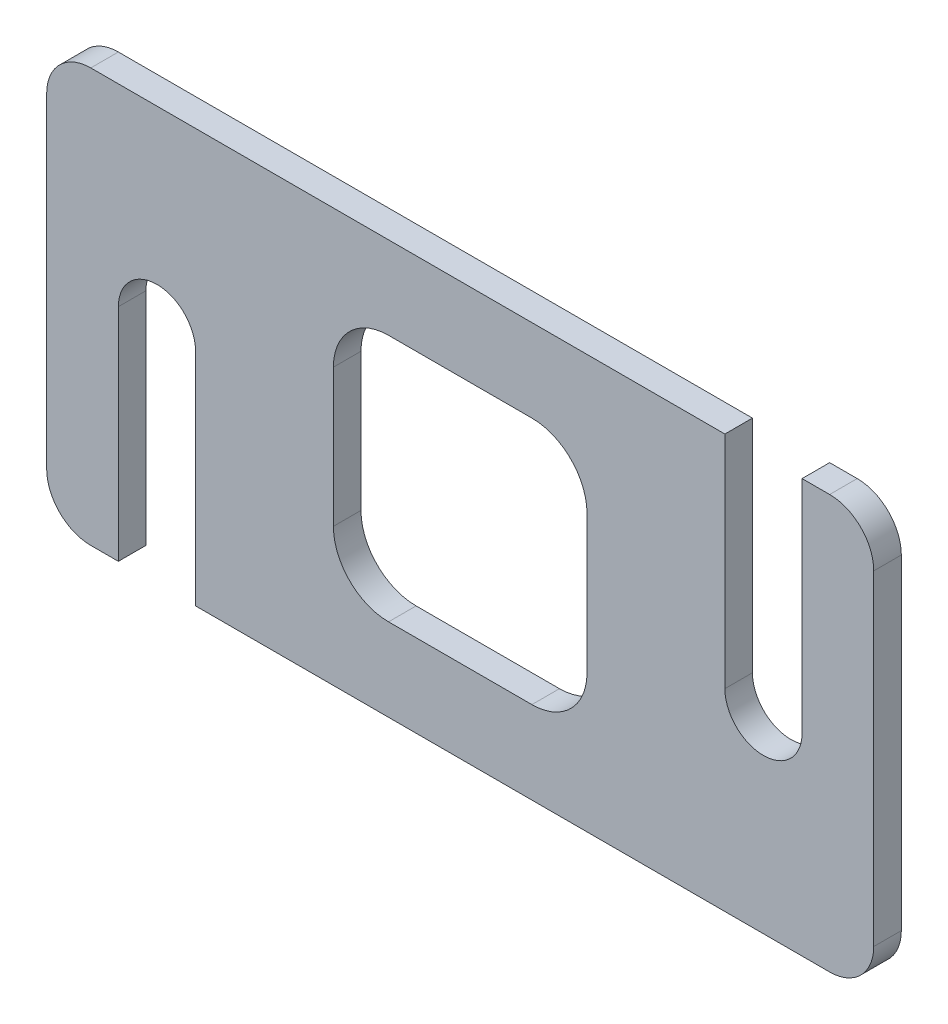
ISO-10303-21;
HEADER;
FILE_DESCRIPTION(('STEP AP214'),'2;1');
FILE_NAME('part.step','',(''),(''),'','','');
FILE_SCHEMA(('AUTOMOTIVE_DESIGN { 1 0 10303 214 1 1 1 1 }'));
ENDSEC;
DATA;
#1=APPLICATION_CONTEXT('core data for automotive mechanical design processes');
#2=APPLICATION_PROTOCOL_DEFINITION('international standard','automotive_design',2000,#1);
#3=PRODUCT_CONTEXT('',#1,'mechanical');
#4=PRODUCT('Part','Part','',(#3));
#5=PRODUCT_RELATED_PRODUCT_CATEGORY('part','',(#4));
#6=PRODUCT_DEFINITION_FORMATION('','',#4);
#7=PRODUCT_DEFINITION_CONTEXT('part definition',#1,'design');
#8=PRODUCT_DEFINITION('design','',#6,#7);
#9=PRODUCT_DEFINITION_SHAPE('','',#8);
#10=(LENGTH_UNIT() NAMED_UNIT(*) SI_UNIT(.MILLI.,.METRE.));
#11=(NAMED_UNIT(*) PLANE_ANGLE_UNIT() SI_UNIT($,.RADIAN.));
#12=(NAMED_UNIT(*) SI_UNIT($,.STERADIAN.) SOLID_ANGLE_UNIT());
#13=UNCERTAINTY_MEASURE_WITH_UNIT(LENGTH_MEASURE(1.E-05),#10,'distance_accuracy_value','');
#14=(GEOMETRIC_REPRESENTATION_CONTEXT(3) GLOBAL_UNCERTAINTY_ASSIGNED_CONTEXT((#13)) GLOBAL_UNIT_ASSIGNED_CONTEXT((#10,
#11,#12)) REPRESENTATION_CONTEXT('',''));
#15=CARTESIAN_POINT('',(0.,0.,0.));
#16=DIRECTION('',(0.,0.,1.));
#17=DIRECTION('',(1.,0.,0.));
#18=AXIS2_PLACEMENT_3D('',#15,#16,#17);
#19=CARTESIAN_POINT('',(-75.,37.5,5.));
#20=DIRECTION('',(0.,-1.,0.));
#21=DIRECTION('',(0.,0.,-1.));
#22=AXIS2_PLACEMENT_3D('',#19,#20,#21);
#23=PLANE('',#22);
#24=DIRECTION('',(-1.,0.,0.));
#25=VECTOR('',#24,1.);
#26=CARTESIAN_POINT('',(-75.,37.5,0.));
#27=LINE('',#26,#25);
#28=CARTESIAN_POINT('',(48.,37.5,0.));
#29=VERTEX_POINT('',#28);
#30=CARTESIAN_POINT('',(-67.,37.5,0.));
#31=VERTEX_POINT('',#30);
#32=EDGE_CURVE('E341',#29,#31,#27,.T.);
#33=ORIENTED_EDGE('',*,*,#32,.T.);
#34=DIRECTION('',(0.,0.,-1.));
#35=VECTOR('',#34,1.);
#36=CARTESIAN_POINT('',(-67.,37.5,5.));
#37=LINE('',#36,#35);
#38=CARTESIAN_POINT('',(-67.,37.5,5.));
#39=VERTEX_POINT('',#38);
#40=EDGE_CURVE('E361',#31,#39,#37,.F.);
#41=ORIENTED_EDGE('',*,*,#40,.T.);
#42=DIRECTION('',(-1.,0.,0.));
#43=VECTOR('',#42,1.);
#44=CARTESIAN_POINT('',(-75.,37.5,5.));
#45=LINE('',#44,#43);
#46=CARTESIAN_POINT('',(48.,37.5,5.));
#47=VERTEX_POINT('',#46);
#48=EDGE_CURVE('E329',#47,#39,#45,.T.);
#49=ORIENTED_EDGE('',*,*,#48,.F.);
#50=DIRECTION('',(0.,0.,1.));
#51=VECTOR('',#50,1.);
#52=CARTESIAN_POINT('',(48.,37.5,0.));
#53=LINE('',#52,#51);
#54=EDGE_CURVE('E291',#29,#47,#53,.T.);
#55=ORIENTED_EDGE('',*,*,#54,.F.);
#56=EDGE_LOOP('',(#33,#41,#49,#55));
#57=FACE_BOUND('',#56,.T.);
#58=ADVANCED_FACE('F34',(#57),#23,.F.);
#59=CARTESIAN_POINT('',(-75.,-37.5,5.));
#60=DIRECTION('',(0.,1.,0.));
#61=DIRECTION('',(0.,0.,1.));
#62=AXIS2_PLACEMENT_3D('',#59,#60,#61);
#63=PLANE('',#62);
#64=DIRECTION('',(1.,0.,0.));
#65=VECTOR('',#64,1.);
#66=CARTESIAN_POINT('',(-75.,-37.5,5.));
#67=LINE('',#66,#65);
#68=CARTESIAN_POINT('',(-67.,-37.5,5.));
#69=VERTEX_POINT('',#68);
#70=CARTESIAN_POINT('',(-62.,-37.5,5.));
#71=VERTEX_POINT('',#70);
#72=EDGE_CURVE('E337',#69,#71,#67,.T.);
#73=ORIENTED_EDGE('',*,*,#72,.F.);
#74=DIRECTION('',(0.,0.,-1.));
#75=VECTOR('',#74,1.);
#76=CARTESIAN_POINT('',(-67.,-37.5,5.));
#77=LINE('',#76,#75);
#78=CARTESIAN_POINT('',(-67.,-37.5,0.));
#79=VERTEX_POINT('',#78);
#80=EDGE_CURVE('E11',#69,#79,#77,.T.);
#81=ORIENTED_EDGE('',*,*,#80,.T.);
#82=DIRECTION('',(1.,0.,0.));
#83=VECTOR('',#82,1.);
#84=CARTESIAN_POINT('',(-75.,-37.5,0.));
#85=LINE('',#84,#83);
#86=CARTESIAN_POINT('',(-62.,-37.5,0.));
#87=VERTEX_POINT('',#86);
#88=EDGE_CURVE('E330',#79,#87,#85,.T.);
#89=ORIENTED_EDGE('',*,*,#88,.T.);
#90=DIRECTION('',(0.,0.,1.));
#91=VECTOR('',#90,1.);
#92=CARTESIAN_POINT('',(-62.,-37.5,0.));
#93=LINE('',#92,#91);
#94=EDGE_CURVE('E310',#87,#71,#93,.T.);
#95=ORIENTED_EDGE('',*,*,#94,.T.);
#96=EDGE_LOOP('',(#73,#81,#89,#95));
#97=FACE_BOUND('',#96,.T.);
#98=ADVANCED_FACE('F432',(#97),#63,.F.);
#99=CARTESIAN_POINT('',(75.,-37.5,5.));
#100=DIRECTION('',(-1.,0.,0.));
#101=DIRECTION('',(0.,0.,1.));
#102=AXIS2_PLACEMENT_3D('',#99,#100,#101);
#103=PLANE('',#102);
#104=DIRECTION('',(0.,1.,0.));
#105=VECTOR('',#104,1.);
#106=CARTESIAN_POINT('',(75.,-37.5,0.));
#107=LINE('',#106,#105);
#108=CARTESIAN_POINT('',(75.,-29.5,0.));
#109=VERTEX_POINT('',#108);
#110=CARTESIAN_POINT('',(75.,29.5,0.));
#111=VERTEX_POINT('',#110);
#112=EDGE_CURVE('E320',#109,#111,#107,.T.);
#113=ORIENTED_EDGE('',*,*,#112,.T.);
#114=DIRECTION('',(0.,0.,-1.));
#115=VECTOR('',#114,1.);
#116=CARTESIAN_POINT('',(75.,29.5,5.));
#117=LINE('',#116,#115);
#118=CARTESIAN_POINT('',(75.,29.5,5.));
#119=VERTEX_POINT('',#118);
#120=EDGE_CURVE('E57',#111,#119,#117,.F.);
#121=ORIENTED_EDGE('',*,*,#120,.T.);
#122=DIRECTION('',(0.,1.,0.));
#123=VECTOR('',#122,1.);
#124=CARTESIAN_POINT('',(75.,-37.5,5.));
#125=LINE('',#124,#123);
#126=CARTESIAN_POINT('',(75.,-29.5,5.));
#127=VERTEX_POINT('',#126);
#128=EDGE_CURVE('E327',#127,#119,#125,.T.);
#129=ORIENTED_EDGE('',*,*,#128,.F.);
#130=DIRECTION('',(0.,0.,-1.));
#131=VECTOR('',#130,1.);
#132=CARTESIAN_POINT('',(75.,-29.5,5.));
#133=LINE('',#132,#131);
#134=EDGE_CURVE('E373',#127,#109,#133,.T.);
#135=ORIENTED_EDGE('',*,*,#134,.T.);
#136=EDGE_LOOP('',(#113,#121,#129,#135));
#137=FACE_BOUND('',#136,.T.);
#138=ADVANCED_FACE('F393',(#137),#103,.F.);
#139=CARTESIAN_POINT('',(67.,37.5,5.));
#140=VERTEX_POINT('',#139);
#141=CARTESIAN_POINT('',(62.,37.5,5.));
#142=VERTEX_POINT('',#141);
#143=EDGE_CURVE('E331',#140,#142,#45,.T.);
#144=ORIENTED_EDGE('',*,*,#143,.F.);
#145=DIRECTION('',(0.,0.,-1.));
#146=VECTOR('',#145,1.);
#147=CARTESIAN_POINT('',(67.,37.5,5.));
#148=LINE('',#147,#146);
#149=CARTESIAN_POINT('',(67.,37.5,0.));
#150=VERTEX_POINT('',#149);
#151=EDGE_CURVE('E370',#140,#150,#148,.T.);
#152=ORIENTED_EDGE('',*,*,#151,.T.);
#153=CARTESIAN_POINT('',(62.,37.5,0.));
#154=VERTEX_POINT('',#153);
#155=EDGE_CURVE('E342',#150,#154,#27,.T.);
#156=ORIENTED_EDGE('',*,*,#155,.T.);
#157=DIRECTION('',(0.,0.,1.));
#158=VECTOR('',#157,1.);
#159=CARTESIAN_POINT('',(62.,37.5,0.));
#160=LINE('',#159,#158);
#161=EDGE_CURVE('E294',#154,#142,#160,.T.);
#162=ORIENTED_EDGE('',*,*,#161,.T.);
#163=EDGE_LOOP('',(#144,#152,#156,#162));
#164=FACE_BOUND('',#163,.T.);
#165=ADVANCED_FACE('F400',(#164),#23,.F.);
#166=CARTESIAN_POINT('',(-75.,-37.5,5.));
#167=DIRECTION('',(1.,0.,0.));
#168=DIRECTION('',(0.,0.,-1.));
#169=AXIS2_PLACEMENT_3D('',#166,#167,#168);
#170=PLANE('',#169);
#171=DIRECTION('',(0.,-1.,0.));
#172=VECTOR('',#171,1.);
#173=CARTESIAN_POINT('',(-75.,-37.5,5.));
#174=LINE('',#173,#172);
#175=CARTESIAN_POINT('',(-75.,29.5,5.));
#176=VERTEX_POINT('',#175);
#177=CARTESIAN_POINT('',(-75.,-29.5,5.));
#178=VERTEX_POINT('',#177);
#179=EDGE_CURVE('E333',#176,#178,#174,.T.);
#180=ORIENTED_EDGE('',*,*,#179,.F.);
#181=DIRECTION('',(0.,0.,-1.));
#182=VECTOR('',#181,1.);
#183=CARTESIAN_POINT('',(-75.,29.5,5.));
#184=LINE('',#183,#182);
#185=CARTESIAN_POINT('',(-75.,29.5,0.));
#186=VERTEX_POINT('',#185);
#187=EDGE_CURVE('E350',#176,#186,#184,.T.);
#188=ORIENTED_EDGE('',*,*,#187,.T.);
#189=DIRECTION('',(0.,-1.,0.));
#190=VECTOR('',#189,1.);
#191=CARTESIAN_POINT('',(-75.,-37.5,0.));
#192=LINE('',#191,#190);
#193=CARTESIAN_POINT('',(-75.,-29.5,0.));
#194=VERTEX_POINT('',#193);
#195=EDGE_CURVE('E344',#186,#194,#192,.T.);
#196=ORIENTED_EDGE('',*,*,#195,.T.);
#197=DIRECTION('',(0.,0.,-1.));
#198=VECTOR('',#197,1.);
#199=CARTESIAN_POINT('',(-75.,-29.5,5.));
#200=LINE('',#199,#198);
#201=EDGE_CURVE('E339',#194,#178,#200,.F.);
#202=ORIENTED_EDGE('',*,*,#201,.T.);
#203=EDGE_LOOP('',(#180,#188,#196,#202));
#204=FACE_BOUND('',#203,.T.);
#205=ADVANCED_FACE('F425',(#204),#170,.F.);
#206=CARTESIAN_POINT('',(-48.,-37.5,0.));
#207=VERTEX_POINT('',#206);
#208=CARTESIAN_POINT('',(67.,-37.5,0.));
#209=VERTEX_POINT('',#208);
#210=EDGE_CURVE('E347',#207,#209,#85,.T.);
#211=ORIENTED_EDGE('',*,*,#210,.T.);
#212=DIRECTION('',(0.,0.,-1.));
#213=VECTOR('',#212,1.);
#214=CARTESIAN_POINT('',(67.,-37.5,5.));
#215=LINE('',#214,#213);
#216=CARTESIAN_POINT('',(67.,-37.5,5.));
#217=VERTEX_POINT('',#216);
#218=EDGE_CURVE('E42',#209,#217,#215,.F.);
#219=ORIENTED_EDGE('',*,*,#218,.T.);
#220=CARTESIAN_POINT('',(-48.,-37.5,5.));
#221=VERTEX_POINT('',#220);
#222=EDGE_CURVE('E336',#221,#217,#67,.T.);
#223=ORIENTED_EDGE('',*,*,#222,.F.);
#224=DIRECTION('',(0.,0.,1.));
#225=VECTOR('',#224,1.);
#226=CARTESIAN_POINT('',(-48.,-37.5,0.));
#227=LINE('',#226,#225);
#228=EDGE_CURVE('E323',#207,#221,#227,.T.);
#229=ORIENTED_EDGE('',*,*,#228,.F.);
#230=EDGE_LOOP('',(#211,#219,#223,#229));
#231=FACE_BOUND('',#230,.T.);
#232=ADVANCED_FACE('F381',(#231),#63,.F.);
#233=CARTESIAN_POINT('',(0.,0.,5.));
#234=DIRECTION('',(0.,0.,-1.));
#235=DIRECTION('',(-1.,0.,0.));
#236=AXIS2_PLACEMENT_3D('',#233,#234,#235);
#237=PLANE('',#236);
#238=DIRECTION('',(0.,-1.,0.));
#239=VECTOR('',#238,1.);
#240=CARTESIAN_POINT('',(-23.,12.5,5.));
#241=LINE('',#240,#239);
#242=CARTESIAN_POINT('',(-23.,12.5,5.));
#243=VERTEX_POINT('',#242);
#244=CARTESIAN_POINT('',(-23.,-12.4999999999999,5.));
#245=VERTEX_POINT('',#244);
#246=EDGE_CURVE('E243',#243,#245,#241,.T.);
#247=ORIENTED_EDGE('',*,*,#246,.F.);
#248=CARTESIAN_POINT('',(-13.,12.5,5.));
#249=DIRECTION('',(0.,0.,1.));
#250=DIRECTION('',(1.,0.,0.));
#251=AXIS2_PLACEMENT_3D('',#248,#249,#250);
#252=CIRCLE('',#251,10.);
#253=CARTESIAN_POINT('',(-13.,22.5,5.));
#254=VERTEX_POINT('',#253);
#255=EDGE_CURVE('E204',#254,#243,#252,.T.);
#256=ORIENTED_EDGE('',*,*,#255,.F.);
#257=DIRECTION('',(-1.,0.,0.));
#258=VECTOR('',#257,1.);
#259=CARTESIAN_POINT('',(-13.,22.5,5.));
#260=LINE('',#259,#258);
#261=CARTESIAN_POINT('',(12.9999999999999,22.5,5.));
#262=VERTEX_POINT('',#261);
#263=EDGE_CURVE('E223',#262,#254,#260,.T.);
#264=ORIENTED_EDGE('',*,*,#263,.F.);
#265=CARTESIAN_POINT('',(13.,12.5,5.));
#266=DIRECTION('',(0.,0.,1.));
#267=DIRECTION('',(-1.,0.,0.));
#268=AXIS2_PLACEMENT_3D('',#265,#266,#267);
#269=CIRCLE('',#268,10.);
#270=CARTESIAN_POINT('',(23.,12.4999999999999,5.));
#271=VERTEX_POINT('',#270);
#272=EDGE_CURVE('E226',#271,#262,#269,.T.);
#273=ORIENTED_EDGE('',*,*,#272,.F.);
#274=DIRECTION('',(0.,1.,0.));
#275=VECTOR('',#274,1.);
#276=CARTESIAN_POINT('',(23.,12.4999999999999,5.));
#277=LINE('',#276,#275);
#278=CARTESIAN_POINT('',(23.,-12.4999999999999,5.));
#279=VERTEX_POINT('',#278);
#280=EDGE_CURVE('E254',#279,#271,#277,.T.);
#281=ORIENTED_EDGE('',*,*,#280,.F.);
#282=CARTESIAN_POINT('',(13.,-12.5,5.));
#283=DIRECTION('',(0.,0.,1.));
#284=DIRECTION('',(1.,0.,0.));
#285=AXIS2_PLACEMENT_3D('',#282,#283,#284);
#286=CIRCLE('',#285,10.);
#287=CARTESIAN_POINT('',(12.9999999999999,-22.5,5.));
#288=VERTEX_POINT('',#287);
#289=EDGE_CURVE('E251',#288,#279,#286,.T.);
#290=ORIENTED_EDGE('',*,*,#289,.F.);
#291=DIRECTION('',(1.,0.,0.));
#292=VECTOR('',#291,1.);
#293=CARTESIAN_POINT('',(-12.9999999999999,-22.5,5.));
#294=LINE('',#293,#292);
#295=CARTESIAN_POINT('',(-12.9999999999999,-22.5,5.));
#296=VERTEX_POINT('',#295);
#297=EDGE_CURVE('E248',#296,#288,#294,.T.);
#298=ORIENTED_EDGE('',*,*,#297,.F.);
#299=CARTESIAN_POINT('',(-13.,-12.5,5.));
#300=DIRECTION('',(0.,0.,1.));
#301=DIRECTION('',(1.,0.,0.));
#302=AXIS2_PLACEMENT_3D('',#299,#300,#301);
#303=CIRCLE('',#302,10.);
#304=EDGE_CURVE('E245',#245,#296,#303,.T.);
#305=ORIENTED_EDGE('',*,*,#304,.F.);
#306=EDGE_LOOP('',(#247,#256,#264,#273,#281,#290,#298,#305));
#307=FACE_BOUND('',#306,.T.);
#308=ORIENTED_EDGE('',*,*,#48,.T.);
#309=CARTESIAN_POINT('',(-67.,29.5,5.));
#310=DIRECTION('',(0.,0.,-1.));
#311=DIRECTION('',(-1.,0.,0.));
#312=AXIS2_PLACEMENT_3D('',#309,#310,#311);
#313=CIRCLE('',#312,8.);
#314=EDGE_CURVE('E368',#39,#176,#313,.F.);
#315=ORIENTED_EDGE('',*,*,#314,.T.);
#316=ORIENTED_EDGE('',*,*,#179,.T.);
#317=CARTESIAN_POINT('',(-67.,-29.5,5.));
#318=DIRECTION('',(0.,0.,-1.));
#319=DIRECTION('',(-1.,0.,0.));
#320=AXIS2_PLACEMENT_3D('',#317,#318,#319);
#321=CIRCLE('',#320,8.);
#322=EDGE_CURVE('E363',#178,#69,#321,.F.);
#323=ORIENTED_EDGE('',*,*,#322,.T.);
#324=ORIENTED_EDGE('',*,*,#72,.T.);
#325=DIRECTION('',(0.,-1.,0.));
#326=VECTOR('',#325,1.);
#327=CARTESIAN_POINT('',(-62.,-37.5,5.));
#328=LINE('',#327,#326);
#329=CARTESIAN_POINT('',(-62.,2.49999999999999,5.));
#330=VERTEX_POINT('',#329);
#331=EDGE_CURVE('E293',#330,#71,#328,.T.);
#332=ORIENTED_EDGE('',*,*,#331,.F.);
#333=CARTESIAN_POINT('',(-55.,2.49999999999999,5.));
#334=DIRECTION('',(0.,0.,1.));
#335=DIRECTION('',(1.,0.,0.));
#336=AXIS2_PLACEMENT_3D('',#333,#334,#335);
#337=CIRCLE('',#336,7.);
#338=CARTESIAN_POINT('',(-48.,2.49999999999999,5.));
#339=VERTEX_POINT('',#338);
#340=EDGE_CURVE('E304',#339,#330,#337,.T.);
#341=ORIENTED_EDGE('',*,*,#340,.F.);
#342=DIRECTION('',(0.,1.,0.));
#343=VECTOR('',#342,1.);
#344=CARTESIAN_POINT('',(-48.,-37.5,5.));
#345=LINE('',#344,#343);
#346=EDGE_CURVE('E313',#221,#339,#345,.T.);
#347=ORIENTED_EDGE('',*,*,#346,.F.);
#348=ORIENTED_EDGE('',*,*,#222,.T.);
#349=CARTESIAN_POINT('',(67.,-29.5,5.));
#350=DIRECTION('',(0.,0.,-1.));
#351=DIRECTION('',(-1.,0.,0.));
#352=AXIS2_PLACEMENT_3D('',#349,#350,#351);
#353=CIRCLE('',#352,8.);
#354=EDGE_CURVE('E365',#217,#127,#353,.F.);
#355=ORIENTED_EDGE('',*,*,#354,.T.);
#356=ORIENTED_EDGE('',*,*,#128,.T.);
#357=CARTESIAN_POINT('',(67.,29.5,5.));
#358=DIRECTION('',(0.,0.,-1.));
#359=DIRECTION('',(-1.,0.,0.));
#360=AXIS2_PLACEMENT_3D('',#357,#358,#359);
#361=CIRCLE('',#360,8.);
#362=EDGE_CURVE('E49',#119,#140,#361,.F.);
#363=ORIENTED_EDGE('',*,*,#362,.T.);
#364=ORIENTED_EDGE('',*,*,#143,.T.);
#365=DIRECTION('',(0.,1.,0.));
#366=VECTOR('',#365,1.);
#367=CARTESIAN_POINT('',(62.,37.5,5.));
#368=LINE('',#367,#366);
#369=CARTESIAN_POINT('',(62.,-2.50000000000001,5.));
#370=VERTEX_POINT('',#369);
#371=EDGE_CURVE('E277',#370,#142,#368,.T.);
#372=ORIENTED_EDGE('',*,*,#371,.F.);
#373=CARTESIAN_POINT('',(55.,-2.50000000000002,5.));
#374=DIRECTION('',(0.,0.,1.));
#375=DIRECTION('',(1.,0.,0.));
#376=AXIS2_PLACEMENT_3D('',#373,#374,#375);
#377=CIRCLE('',#376,7.);
#378=CARTESIAN_POINT('',(48.,-2.50000000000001,5.));
#379=VERTEX_POINT('',#378);
#380=EDGE_CURVE('E286',#379,#370,#377,.T.);
#381=ORIENTED_EDGE('',*,*,#380,.F.);
#382=DIRECTION('',(0.,-1.,0.));
#383=VECTOR('',#382,1.);
#384=CARTESIAN_POINT('',(48.,37.5,5.));
#385=LINE('',#384,#383);
#386=EDGE_CURVE('E261',#47,#379,#385,.T.);
#387=ORIENTED_EDGE('',*,*,#386,.F.);
#388=EDGE_LOOP('',(#308,#315,#316,#323,#324,#332,#341,#347,#348,#355,#356,#363,#364,#372,#381,#387));
#389=FACE_BOUND('',#388,.T.);
#390=ADVANCED_FACE('F388',(#307,#389),#237,.F.);
#391=CARTESIAN_POINT('',(0.,0.,0.));
#392=DIRECTION('',(0.,0.,-1.));
#393=DIRECTION('',(-1.,0.,0.));
#394=AXIS2_PLACEMENT_3D('',#391,#392,#393);
#395=PLANE('',#394);
#396=CARTESIAN_POINT('',(-13.,12.5,0.));
#397=DIRECTION('',(0.,0.,1.));
#398=DIRECTION('',(1.,0.,0.));
#399=AXIS2_PLACEMENT_3D('',#396,#397,#398);
#400=CIRCLE('',#399,10.);
#401=CARTESIAN_POINT('',(-13.,22.5,0.));
#402=VERTEX_POINT('',#401);
#403=CARTESIAN_POINT('',(-23.,12.5,0.));
#404=VERTEX_POINT('',#403);
#405=EDGE_CURVE('E201',#402,#404,#400,.T.);
#406=ORIENTED_EDGE('',*,*,#405,.T.);
#407=DIRECTION('',(0.,-1.,0.));
#408=VECTOR('',#407,1.);
#409=CARTESIAN_POINT('',(-23.,12.5,0.));
#410=LINE('',#409,#408);
#411=CARTESIAN_POINT('',(-23.,-12.4999999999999,0.));
#412=VERTEX_POINT('',#411);
#413=EDGE_CURVE('E213',#404,#412,#410,.T.);
#414=ORIENTED_EDGE('',*,*,#413,.T.);
#415=CARTESIAN_POINT('',(-13.,-12.5,0.));
#416=DIRECTION('',(0.,0.,1.));
#417=DIRECTION('',(1.,0.,0.));
#418=AXIS2_PLACEMENT_3D('',#415,#416,#417);
#419=CIRCLE('',#418,10.);
#420=CARTESIAN_POINT('',(-12.9999999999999,-22.5,0.));
#421=VERTEX_POINT('',#420);
#422=EDGE_CURVE('E217',#412,#421,#419,.T.);
#423=ORIENTED_EDGE('',*,*,#422,.T.);
#424=DIRECTION('',(1.,0.,0.));
#425=VECTOR('',#424,1.);
#426=CARTESIAN_POINT('',(-12.9999999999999,-22.5,0.));
#427=LINE('',#426,#425);
#428=CARTESIAN_POINT('',(12.9999999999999,-22.5,0.));
#429=VERTEX_POINT('',#428);
#430=EDGE_CURVE('E230',#421,#429,#427,.T.);
#431=ORIENTED_EDGE('',*,*,#430,.T.);
#432=CARTESIAN_POINT('',(13.,-12.5,0.));
#433=DIRECTION('',(0.,0.,1.));
#434=DIRECTION('',(1.,0.,0.));
#435=AXIS2_PLACEMENT_3D('',#432,#433,#434);
#436=CIRCLE('',#435,10.);
#437=CARTESIAN_POINT('',(23.,-12.4999999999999,0.));
#438=VERTEX_POINT('',#437);
#439=EDGE_CURVE('E233',#429,#438,#436,.T.);
#440=ORIENTED_EDGE('',*,*,#439,.T.);
#441=DIRECTION('',(0.,1.,0.));
#442=VECTOR('',#441,1.);
#443=CARTESIAN_POINT('',(23.,12.4999999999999,0.));
#444=LINE('',#443,#442);
#445=CARTESIAN_POINT('',(23.,12.4999999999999,0.));
#446=VERTEX_POINT('',#445);
#447=EDGE_CURVE('E236',#438,#446,#444,.T.);
#448=ORIENTED_EDGE('',*,*,#447,.T.);
#449=CARTESIAN_POINT('',(13.,12.5,0.));
#450=DIRECTION('',(0.,0.,1.));
#451=DIRECTION('',(-1.,0.,0.));
#452=AXIS2_PLACEMENT_3D('',#449,#450,#451);
#453=CIRCLE('',#452,10.);
#454=CARTESIAN_POINT('',(12.9999999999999,22.5,0.));
#455=VERTEX_POINT('',#454);
#456=EDGE_CURVE('E239',#446,#455,#453,.T.);
#457=ORIENTED_EDGE('',*,*,#456,.T.);
#458=DIRECTION('',(-1.,0.,0.));
#459=VECTOR('',#458,1.);
#460=CARTESIAN_POINT('',(-13.,22.5,0.));
#461=LINE('',#460,#459);
#462=EDGE_CURVE('E209',#455,#402,#461,.T.);
#463=ORIENTED_EDGE('',*,*,#462,.T.);
#464=EDGE_LOOP('',(#406,#414,#423,#431,#440,#448,#457,#463));
#465=FACE_BOUND('',#464,.T.);
#466=ORIENTED_EDGE('',*,*,#195,.F.);
#467=CARTESIAN_POINT('',(-67.,29.5,0.));
#468=DIRECTION('',(0.,0.,-1.));
#469=DIRECTION('',(-1.,0.,0.));
#470=AXIS2_PLACEMENT_3D('',#467,#468,#469);
#471=CIRCLE('',#470,8.);
#472=EDGE_CURVE('E359',#186,#31,#471,.T.);
#473=ORIENTED_EDGE('',*,*,#472,.T.);
#474=ORIENTED_EDGE('',*,*,#32,.F.);
#475=DIRECTION('',(0.,-1.,0.));
#476=VECTOR('',#475,1.);
#477=CARTESIAN_POINT('',(48.,37.5,0.));
#478=LINE('',#477,#476);
#479=CARTESIAN_POINT('',(48.,-2.50000000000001,0.));
#480=VERTEX_POINT('',#479);
#481=EDGE_CURVE('E273',#29,#480,#478,.T.);
#482=ORIENTED_EDGE('',*,*,#481,.T.);
#483=CARTESIAN_POINT('',(55.,-2.50000000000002,0.));
#484=DIRECTION('',(0.,0.,1.));
#485=DIRECTION('',(1.,0.,0.));
#486=AXIS2_PLACEMENT_3D('',#483,#484,#485);
#487=CIRCLE('',#486,7.);
#488=CARTESIAN_POINT('',(62.,-2.50000000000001,0.));
#489=VERTEX_POINT('',#488);
#490=EDGE_CURVE('E276',#480,#489,#487,.T.);
#491=ORIENTED_EDGE('',*,*,#490,.T.);
#492=DIRECTION('',(0.,1.,0.));
#493=VECTOR('',#492,1.);
#494=CARTESIAN_POINT('',(62.,37.5,0.));
#495=LINE('',#494,#493);
#496=EDGE_CURVE('E280',#489,#154,#495,.T.);
#497=ORIENTED_EDGE('',*,*,#496,.T.);
#498=ORIENTED_EDGE('',*,*,#155,.F.);
#499=CARTESIAN_POINT('',(67.,29.5,0.));
#500=DIRECTION('',(0.,0.,-1.));
#501=DIRECTION('',(-1.,0.,0.));
#502=AXIS2_PLACEMENT_3D('',#499,#500,#501);
#503=CIRCLE('',#502,8.);
#504=EDGE_CURVE('E357',#150,#111,#503,.T.);
#505=ORIENTED_EDGE('',*,*,#504,.T.);
#506=ORIENTED_EDGE('',*,*,#112,.F.);
#507=CARTESIAN_POINT('',(67.,-29.5,0.));
#508=DIRECTION('',(0.,0.,-1.));
#509=DIRECTION('',(-1.,0.,0.));
#510=AXIS2_PLACEMENT_3D('',#507,#508,#509);
#511=CIRCLE('',#510,8.);
#512=EDGE_CURVE('E355',#109,#209,#511,.T.);
#513=ORIENTED_EDGE('',*,*,#512,.T.);
#514=ORIENTED_EDGE('',*,*,#210,.F.);
#515=DIRECTION('',(0.,1.,0.));
#516=VECTOR('',#515,1.);
#517=CARTESIAN_POINT('',(-48.,-37.5,0.));
#518=LINE('',#517,#516);
#519=CARTESIAN_POINT('',(-48.,2.49999999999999,0.));
#520=VERTEX_POINT('',#519);
#521=EDGE_CURVE('E303',#207,#520,#518,.T.);
#522=ORIENTED_EDGE('',*,*,#521,.T.);
#523=CARTESIAN_POINT('',(-55.,2.49999999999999,0.));
#524=DIRECTION('',(0.,0.,1.));
#525=DIRECTION('',(1.,0.,0.));
#526=AXIS2_PLACEMENT_3D('',#523,#524,#525);
#527=CIRCLE('',#526,7.);
#528=CARTESIAN_POINT('',(-62.,2.49999999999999,0.));
#529=VERTEX_POINT('',#528);
#530=EDGE_CURVE('E307',#520,#529,#527,.T.);
#531=ORIENTED_EDGE('',*,*,#530,.T.);
#532=DIRECTION('',(0.,-1.,0.));
#533=VECTOR('',#532,1.);
#534=CARTESIAN_POINT('',(-62.,-37.5,0.));
#535=LINE('',#534,#533);
#536=EDGE_CURVE('E300',#529,#87,#535,.T.);
#537=ORIENTED_EDGE('',*,*,#536,.T.);
#538=ORIENTED_EDGE('',*,*,#88,.F.);
#539=CARTESIAN_POINT('',(-67.,-29.5,0.));
#540=DIRECTION('',(0.,0.,-1.));
#541=DIRECTION('',(-1.,0.,0.));
#542=AXIS2_PLACEMENT_3D('',#539,#540,#541);
#543=CIRCLE('',#542,8.);
#544=EDGE_CURVE('E353',#79,#194,#543,.T.);
#545=ORIENTED_EDGE('',*,*,#544,.T.);
#546=EDGE_LOOP('',(#466,#473,#474,#482,#491,#497,#498,#505,#506,#513,#514,#522,#531,#537,#538,#545));
#547=FACE_BOUND('',#546,.T.);
#548=ADVANCED_FACE('F219',(#465,#547),#395,.T.);
#549=CARTESIAN_POINT('',(-62.,-37.5,0.));
#550=DIRECTION('',(-1.,0.,0.));
#551=DIRECTION('',(0.,0.,1.));
#552=AXIS2_PLACEMENT_3D('',#549,#550,#551);
#553=PLANE('',#552);
#554=ORIENTED_EDGE('',*,*,#331,.T.);
#555=ORIENTED_EDGE('',*,*,#94,.F.);
#556=ORIENTED_EDGE('',*,*,#536,.F.);
#557=DIRECTION('',(0.,0.,1.));
#558=VECTOR('',#557,1.);
#559=CARTESIAN_POINT('',(-62.,2.49999999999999,0.));
#560=LINE('',#559,#558);
#561=EDGE_CURVE('E318',#529,#330,#560,.T.);
#562=ORIENTED_EDGE('',*,*,#561,.T.);
#563=EDGE_LOOP('',(#554,#555,#556,#562));
#564=FACE_BOUND('',#563,.T.);
#565=ADVANCED_FACE('F437',(#564),#553,.F.);
#566=CARTESIAN_POINT('',(-55.,2.49999999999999,0.));
#567=DIRECTION('',(0.,0.,1.));
#568=DIRECTION('',(1.,0.,0.));
#569=AXIS2_PLACEMENT_3D('',#566,#567,#568);
#570=CYLINDRICAL_SURFACE('',#569,7.);
#571=ORIENTED_EDGE('',*,*,#340,.T.);
#572=ORIENTED_EDGE('',*,*,#561,.F.);
#573=ORIENTED_EDGE('',*,*,#530,.F.);
#574=DIRECTION('',(0.,0.,1.));
#575=VECTOR('',#574,1.);
#576=CARTESIAN_POINT('',(-48.,2.49999999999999,0.));
#577=LINE('',#576,#575);
#578=EDGE_CURVE('E321',#520,#339,#577,.T.);
#579=ORIENTED_EDGE('',*,*,#578,.T.);
#580=EDGE_LOOP('',(#571,#572,#573,#579));
#581=FACE_BOUND('',#580,.T.);
#582=ADVANCED_FACE('F440',(#581),#570,.F.);
#583=CARTESIAN_POINT('',(-48.,-37.5,0.));
#584=DIRECTION('',(1.,0.,0.));
#585=DIRECTION('',(0.,0.,-1.));
#586=AXIS2_PLACEMENT_3D('',#583,#584,#585);
#587=PLANE('',#586);
#588=ORIENTED_EDGE('',*,*,#346,.T.);
#589=ORIENTED_EDGE('',*,*,#578,.F.);
#590=ORIENTED_EDGE('',*,*,#521,.F.);
#591=ORIENTED_EDGE('',*,*,#228,.T.);
#592=EDGE_LOOP('',(#588,#589,#590,#591));
#593=FACE_BOUND('',#592,.T.);
#594=ADVANCED_FACE('F442',(#593),#587,.F.);
#595=CARTESIAN_POINT('',(48.,37.5,0.));
#596=DIRECTION('',(-1.,0.,0.));
#597=DIRECTION('',(0.,-1.,0.));
#598=AXIS2_PLACEMENT_3D('',#595,#596,#597);
#599=PLANE('',#598);
#600=ORIENTED_EDGE('',*,*,#386,.T.);
#601=DIRECTION('',(0.,0.,1.));
#602=VECTOR('',#601,1.);
#603=CARTESIAN_POINT('',(48.,-2.50000000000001,0.));
#604=LINE('',#603,#602);
#605=EDGE_CURVE('E283',#480,#379,#604,.T.);
#606=ORIENTED_EDGE('',*,*,#605,.F.);
#607=ORIENTED_EDGE('',*,*,#481,.F.);
#608=ORIENTED_EDGE('',*,*,#54,.T.);
#609=EDGE_LOOP('',(#600,#606,#607,#608));
#610=FACE_BOUND('',#609,.T.);
#611=ADVANCED_FACE('F444',(#610),#599,.F.);
#612=CARTESIAN_POINT('',(62.,37.5,0.));
#613=DIRECTION('',(1.,0.,0.));
#614=DIRECTION('',(0.,1.,0.));
#615=AXIS2_PLACEMENT_3D('',#612,#613,#614);
#616=PLANE('',#615);
#617=ORIENTED_EDGE('',*,*,#371,.T.);
#618=ORIENTED_EDGE('',*,*,#161,.F.);
#619=ORIENTED_EDGE('',*,*,#496,.F.);
#620=DIRECTION('',(0.,0.,1.));
#621=VECTOR('',#620,1.);
#622=CARTESIAN_POINT('',(62.,-2.50000000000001,0.));
#623=LINE('',#622,#621);
#624=EDGE_CURVE('E297',#489,#370,#623,.T.);
#625=ORIENTED_EDGE('',*,*,#624,.T.);
#626=EDGE_LOOP('',(#617,#618,#619,#625));
#627=FACE_BOUND('',#626,.T.);
#628=ADVANCED_FACE('F405',(#627),#616,.F.);
#629=CARTESIAN_POINT('',(55.,-2.50000000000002,0.));
#630=DIRECTION('',(0.,0.,1.));
#631=DIRECTION('',(1.,0.,0.));
#632=AXIS2_PLACEMENT_3D('',#629,#630,#631);
#633=CYLINDRICAL_SURFACE('',#632,7.);
#634=ORIENTED_EDGE('',*,*,#380,.T.);
#635=ORIENTED_EDGE('',*,*,#624,.F.);
#636=ORIENTED_EDGE('',*,*,#490,.F.);
#637=ORIENTED_EDGE('',*,*,#605,.T.);
#638=EDGE_LOOP('',(#634,#635,#636,#637));
#639=FACE_BOUND('',#638,.T.);
#640=ADVANCED_FACE('F409',(#639),#633,.F.);
#641=CARTESIAN_POINT('',(-13.,12.5,0.));
#642=DIRECTION('',(0.,0.,1.));
#643=DIRECTION('',(1.,0.,0.));
#644=AXIS2_PLACEMENT_3D('',#641,#642,#643);
#645=CYLINDRICAL_SURFACE('',#644,10.);
#646=ORIENTED_EDGE('',*,*,#255,.T.);
#647=DIRECTION('',(0.,0.,1.));
#648=VECTOR('',#647,1.);
#649=CARTESIAN_POINT('',(-23.,12.5,0.));
#650=LINE('',#649,#648);
#651=EDGE_CURVE('E197',#404,#243,#650,.T.);
#652=ORIENTED_EDGE('',*,*,#651,.F.);
#653=ORIENTED_EDGE('',*,*,#405,.F.);
#654=DIRECTION('',(0.,0.,1.));
#655=VECTOR('',#654,1.);
#656=CARTESIAN_POINT('',(-13.,22.5,0.));
#657=LINE('',#656,#655);
#658=EDGE_CURVE('E259',#402,#254,#657,.T.);
#659=ORIENTED_EDGE('',*,*,#658,.T.);
#660=EDGE_LOOP('',(#646,#652,#653,#659));
#661=FACE_BOUND('',#660,.T.);
#662=ADVANCED_FACE('F199',(#661),#645,.F.);
#663=CARTESIAN_POINT('',(-13.,22.5,0.));
#664=DIRECTION('',(0.,1.,0.));
#665=DIRECTION('',(0.,0.,1.));
#666=AXIS2_PLACEMENT_3D('',#663,#664,#665);
#667=PLANE('',#666);
#668=ORIENTED_EDGE('',*,*,#263,.T.);
#669=ORIENTED_EDGE('',*,*,#658,.F.);
#670=ORIENTED_EDGE('',*,*,#462,.F.);
#671=DIRECTION('',(0.,0.,1.));
#672=VECTOR('',#671,1.);
#673=CARTESIAN_POINT('',(12.9999999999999,22.5,0.));
#674=LINE('',#673,#672);
#675=EDGE_CURVE('E262',#455,#262,#674,.T.);
#676=ORIENTED_EDGE('',*,*,#675,.T.);
#677=EDGE_LOOP('',(#668,#669,#670,#676));
#678=FACE_BOUND('',#677,.T.);
#679=ADVANCED_FACE('F604',(#678),#667,.F.);
#680=CARTESIAN_POINT('',(13.,12.5,0.));
#681=DIRECTION('',(0.,0.,1.));
#682=DIRECTION('',(1.,0.,0.));
#683=AXIS2_PLACEMENT_3D('',#680,#681,#682);
#684=CYLINDRICAL_SURFACE('',#683,10.);
#685=ORIENTED_EDGE('',*,*,#272,.T.);
#686=ORIENTED_EDGE('',*,*,#675,.F.);
#687=ORIENTED_EDGE('',*,*,#456,.F.);
#688=DIRECTION('',(0.,0.,1.));
#689=VECTOR('',#688,1.);
#690=CARTESIAN_POINT('',(23.,12.4999999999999,0.));
#691=LINE('',#690,#689);
#692=EDGE_CURVE('E264',#446,#271,#691,.T.);
#693=ORIENTED_EDGE('',*,*,#692,.T.);
#694=EDGE_LOOP('',(#685,#686,#687,#693));
#695=FACE_BOUND('',#694,.T.);
#696=ADVANCED_FACE('F594',(#695),#684,.F.);
#697=CARTESIAN_POINT('',(23.,12.4999999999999,0.));
#698=DIRECTION('',(1.,0.,0.));
#699=DIRECTION('',(0.,1.,0.));
#700=AXIS2_PLACEMENT_3D('',#697,#698,#699);
#701=PLANE('',#700);
#702=ORIENTED_EDGE('',*,*,#280,.T.);
#703=ORIENTED_EDGE('',*,*,#692,.F.);
#704=ORIENTED_EDGE('',*,*,#447,.F.);
#705=DIRECTION('',(0.,0.,1.));
#706=VECTOR('',#705,1.);
#707=CARTESIAN_POINT('',(23.,-12.4999999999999,0.));
#708=LINE('',#707,#706);
#709=EDGE_CURVE('E266',#438,#279,#708,.T.);
#710=ORIENTED_EDGE('',*,*,#709,.T.);
#711=EDGE_LOOP('',(#702,#703,#704,#710));
#712=FACE_BOUND('',#711,.T.);
#713=ADVANCED_FACE('F584',(#712),#701,.F.);
#714=CARTESIAN_POINT('',(13.,-12.5,0.));
#715=DIRECTION('',(0.,0.,1.));
#716=DIRECTION('',(1.,0.,0.));
#717=AXIS2_PLACEMENT_3D('',#714,#715,#716);
#718=CYLINDRICAL_SURFACE('',#717,10.);
#719=ORIENTED_EDGE('',*,*,#289,.T.);
#720=ORIENTED_EDGE('',*,*,#709,.F.);
#721=ORIENTED_EDGE('',*,*,#439,.F.);
#722=DIRECTION('',(0.,0.,1.));
#723=VECTOR('',#722,1.);
#724=CARTESIAN_POINT('',(12.9999999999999,-22.5,0.));
#725=LINE('',#724,#723);
#726=EDGE_CURVE('E268',#429,#288,#725,.T.);
#727=ORIENTED_EDGE('',*,*,#726,.T.);
#728=EDGE_LOOP('',(#719,#720,#721,#727));
#729=FACE_BOUND('',#728,.T.);
#730=ADVANCED_FACE('F574',(#729),#718,.F.);
#731=CARTESIAN_POINT('',(-12.9999999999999,-22.5,0.));
#732=DIRECTION('',(0.,-1.,0.));
#733=DIRECTION('',(0.,0.,-1.));
#734=AXIS2_PLACEMENT_3D('',#731,#732,#733);
#735=PLANE('',#734);
#736=ORIENTED_EDGE('',*,*,#297,.T.);
#737=ORIENTED_EDGE('',*,*,#726,.F.);
#738=ORIENTED_EDGE('',*,*,#430,.F.);
#739=DIRECTION('',(0.,0.,1.));
#740=VECTOR('',#739,1.);
#741=CARTESIAN_POINT('',(-12.9999999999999,-22.5,0.));
#742=LINE('',#741,#740);
#743=EDGE_CURVE('E270',#421,#296,#742,.T.);
#744=ORIENTED_EDGE('',*,*,#743,.T.);
#745=EDGE_LOOP('',(#736,#737,#738,#744));
#746=FACE_BOUND('',#745,.T.);
#747=ADVANCED_FACE('F564',(#746),#735,.F.);
#748=CARTESIAN_POINT('',(-13.,-12.5,0.));
#749=DIRECTION('',(0.,0.,1.));
#750=DIRECTION('',(1.,0.,0.));
#751=AXIS2_PLACEMENT_3D('',#748,#749,#750);
#752=CYLINDRICAL_SURFACE('',#751,10.);
#753=ORIENTED_EDGE('',*,*,#304,.T.);
#754=ORIENTED_EDGE('',*,*,#743,.F.);
#755=ORIENTED_EDGE('',*,*,#422,.F.);
#756=DIRECTION('',(0.,0.,1.));
#757=VECTOR('',#756,1.);
#758=CARTESIAN_POINT('',(-23.,-12.4999999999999,0.));
#759=LINE('',#758,#757);
#760=EDGE_CURVE('E208',#412,#245,#759,.T.);
#761=ORIENTED_EDGE('',*,*,#760,.T.);
#762=EDGE_LOOP('',(#753,#754,#755,#761));
#763=FACE_BOUND('',#762,.T.);
#764=ADVANCED_FACE('F555',(#763),#752,.F.);
#765=CARTESIAN_POINT('',(-23.,12.5,0.));
#766=DIRECTION('',(-1.,0.,0.));
#767=DIRECTION('',(0.,-1.,0.));
#768=AXIS2_PLACEMENT_3D('',#765,#766,#767);
#769=PLANE('',#768);
#770=ORIENTED_EDGE('',*,*,#246,.T.);
#771=ORIENTED_EDGE('',*,*,#760,.F.);
#772=ORIENTED_EDGE('',*,*,#413,.F.);
#773=ORIENTED_EDGE('',*,*,#651,.T.);
#774=EDGE_LOOP('',(#770,#771,#772,#773));
#775=FACE_BOUND('',#774,.T.);
#776=ADVANCED_FACE('F214',(#775),#769,.F.);
#777=CARTESIAN_POINT('',(-67.,29.5,5.));
#778=DIRECTION('',(0.,0.,-1.));
#779=DIRECTION('',(-1.,0.,0.));
#780=AXIS2_PLACEMENT_3D('',#777,#778,#779);
#781=CYLINDRICAL_SURFACE('',#780,8.);
#782=ORIENTED_EDGE('',*,*,#314,.F.);
#783=ORIENTED_EDGE('',*,*,#40,.F.);
#784=ORIENTED_EDGE('',*,*,#472,.F.);
#785=ORIENTED_EDGE('',*,*,#187,.F.);
#786=EDGE_LOOP('',(#782,#783,#784,#785));
#787=FACE_BOUND('',#786,.T.);
#788=ADVANCED_FACE('F420',(#787),#781,.T.);
#789=CARTESIAN_POINT('',(67.,29.5,5.));
#790=DIRECTION('',(0.,0.,-1.));
#791=DIRECTION('',(-1.,0.,0.));
#792=AXIS2_PLACEMENT_3D('',#789,#790,#791);
#793=CYLINDRICAL_SURFACE('',#792,8.);
#794=ORIENTED_EDGE('',*,*,#362,.F.);
#795=ORIENTED_EDGE('',*,*,#120,.F.);
#796=ORIENTED_EDGE('',*,*,#504,.F.);
#797=ORIENTED_EDGE('',*,*,#151,.F.);
#798=EDGE_LOOP('',(#794,#795,#796,#797));
#799=FACE_BOUND('',#798,.T.);
#800=ADVANCED_FACE('F398',(#799),#793,.T.);
#801=CARTESIAN_POINT('',(67.,-29.5,5.));
#802=DIRECTION('',(0.,0.,-1.));
#803=DIRECTION('',(-1.,0.,0.));
#804=AXIS2_PLACEMENT_3D('',#801,#802,#803);
#805=CYLINDRICAL_SURFACE('',#804,8.);
#806=ORIENTED_EDGE('',*,*,#354,.F.);
#807=ORIENTED_EDGE('',*,*,#218,.F.);
#808=ORIENTED_EDGE('',*,*,#512,.F.);
#809=ORIENTED_EDGE('',*,*,#134,.F.);
#810=EDGE_LOOP('',(#806,#807,#808,#809));
#811=FACE_BOUND('',#810,.T.);
#812=ADVANCED_FACE('F391',(#811),#805,.T.);
#813=CARTESIAN_POINT('',(-67.,-29.5,5.));
#814=DIRECTION('',(0.,0.,-1.));
#815=DIRECTION('',(-1.,0.,0.));
#816=AXIS2_PLACEMENT_3D('',#813,#814,#815);
#817=CYLINDRICAL_SURFACE('',#816,8.);
#818=ORIENTED_EDGE('',*,*,#322,.F.);
#819=ORIENTED_EDGE('',*,*,#201,.F.);
#820=ORIENTED_EDGE('',*,*,#544,.F.);
#821=ORIENTED_EDGE('',*,*,#80,.F.);
#822=EDGE_LOOP('',(#818,#819,#820,#821));
#823=FACE_BOUND('',#822,.T.);
#824=ADVANCED_FACE('F36',(#823),#817,.T.);
#825=CLOSED_SHELL('',(#58,#98,#138,#165,#205,#232,#390,#548,#565,#582,#594,#611,#628,#640,#662,
#679,#696,#713,#730,#747,#764,#776,#788,#800,#812,#824));
#826=MANIFOLD_SOLID_BREP('B2',#825);
#827=ADVANCED_BREP_SHAPE_REPRESENTATION('',(#18,#826),#14);
#828=SHAPE_DEFINITION_REPRESENTATION(#9,#827);
ENDSEC;
END-ISO-10303-21;
